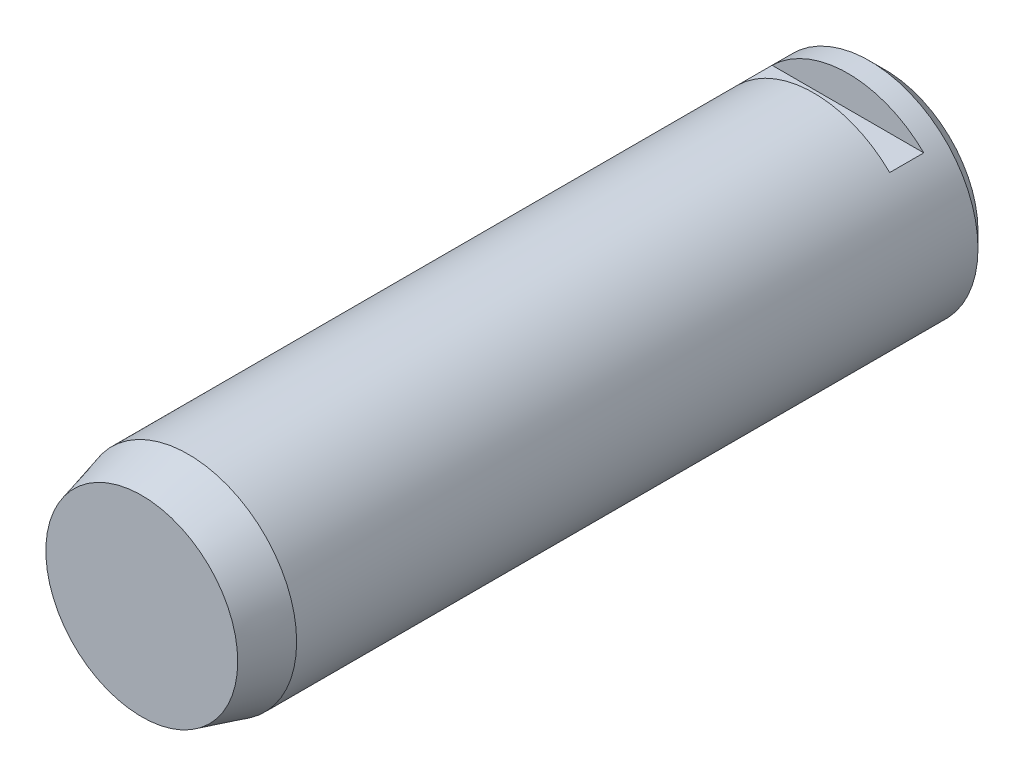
ISO-10303-21;
HEADER;
FILE_DESCRIPTION(('STEP AP214'),'2;1');
FILE_NAME('part.step','',(''),(''),'','','');
FILE_SCHEMA(('AUTOMOTIVE_DESIGN { 1 0 10303 214 1 1 1 1 }'));
ENDSEC;
DATA;
#1=APPLICATION_CONTEXT('core data for automotive mechanical design processes');
#2=APPLICATION_PROTOCOL_DEFINITION('international standard','automotive_design',2000,#1);
#3=PRODUCT_CONTEXT('',#1,'mechanical');
#4=PRODUCT('Part','Part','',(#3));
#5=PRODUCT_RELATED_PRODUCT_CATEGORY('part','',(#4));
#6=PRODUCT_DEFINITION_FORMATION('','',#4);
#7=PRODUCT_DEFINITION_CONTEXT('part definition',#1,'design');
#8=PRODUCT_DEFINITION('design','',#6,#7);
#9=PRODUCT_DEFINITION_SHAPE('','',#8);
#10=(LENGTH_UNIT() NAMED_UNIT(*) SI_UNIT(.MILLI.,.METRE.));
#11=(NAMED_UNIT(*) PLANE_ANGLE_UNIT() SI_UNIT($,.RADIAN.));
#12=(NAMED_UNIT(*) SI_UNIT($,.STERADIAN.) SOLID_ANGLE_UNIT());
#13=UNCERTAINTY_MEASURE_WITH_UNIT(LENGTH_MEASURE(1.E-05),#10,'distance_accuracy_value','');
#14=(GEOMETRIC_REPRESENTATION_CONTEXT(3) GLOBAL_UNCERTAINTY_ASSIGNED_CONTEXT((#13)) GLOBAL_UNIT_ASSIGNED_CONTEXT((#10,
#11,#12)) REPRESENTATION_CONTEXT('',''));
#15=CARTESIAN_POINT('',(0.,0.,0.));
#16=DIRECTION('',(0.,0.,1.));
#17=DIRECTION('',(1.,0.,0.));
#18=AXIS2_PLACEMENT_3D('',#15,#16,#17);
#19=CARTESIAN_POINT('',(0.,0.,240.));
#20=DIRECTION('',(0.,0.,-1.));
#21=DIRECTION('',(-1.,0.,0.));
#22=AXIS2_PLACEMENT_3D('',#19,#20,#21);
#23=CYLINDRICAL_SURFACE('',#22,35.);
#24=CARTESIAN_POINT('',(-8.88178419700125E-13,0.,5.00000000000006));
#25=DIRECTION('',(0.,0.,1.));
#26=DIRECTION('',(1.,0.,0.));
#27=AXIS2_PLACEMENT_3D('',#24,#25,#26);
#28=CIRCLE('',#27,35.);
#29=CARTESIAN_POINT('',(34.9999999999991,0.,5.00000000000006));
#30=VERTEX_POINT('',#29);
#31=EDGE_CURVE('E41',#30,#30,#28,.T.);
#32=ORIENTED_EDGE('',*,*,#31,.T.);
#33=EDGE_LOOP('',(#32));
#34=FACE_BOUND('',#33,.T.);
#35=CARTESIAN_POINT('',(0.,0.,22.9999999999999));
#36=DIRECTION('',(0.,0.,-1.));
#37=DIRECTION('',(-1.,0.,0.));
#38=AXIS2_PLACEMENT_3D('',#35,#36,#37);
#39=CIRCLE('',#38,35.);
#40=CARTESIAN_POINT('',(24.4948974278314,25.0000000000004,22.9999999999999));
#41=VERTEX_POINT('',#40);
#42=CARTESIAN_POINT('',(-24.4948974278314,25.0000000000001,22.9999999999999));
#43=VERTEX_POINT('',#42);
#44=EDGE_CURVE('E47',#41,#43,#39,.F.);
#45=ORIENTED_EDGE('',*,*,#44,.T.);
#46=DIRECTION('',(0.,0.,-1.));
#47=VECTOR('',#46,1.);
#48=CARTESIAN_POINT('',(-24.4948974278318,24.9999999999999,240.));
#49=LINE('',#48,#47);
#50=CARTESIAN_POINT('',(-24.4948974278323,24.9999999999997,11.9999999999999));
#51=VERTEX_POINT('',#50);
#52=EDGE_CURVE('E71',#51,#43,#49,.F.);
#53=ORIENTED_EDGE('',*,*,#52,.F.);
#54=CARTESIAN_POINT('',(0.,-2.22044604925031E-13,11.9999999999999));
#55=DIRECTION('',(0.,0.,1.));
#56=DIRECTION('',(1.,0.,0.));
#57=AXIS2_PLACEMENT_3D('',#54,#55,#56);
#58=CIRCLE('',#57,35.);
#59=CARTESIAN_POINT('',(24.4948974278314,24.9999999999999,11.9999999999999));
#60=VERTEX_POINT('',#59);
#61=EDGE_CURVE('E63',#51,#60,#58,.F.);
#62=ORIENTED_EDGE('',*,*,#61,.T.);
#63=DIRECTION('',(0.,0.,-1.));
#64=VECTOR('',#63,1.);
#65=CARTESIAN_POINT('',(24.4948974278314,24.9999999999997,240.));
#66=LINE('',#65,#64);
#67=EDGE_CURVE('E68',#41,#60,#66,.T.);
#68=ORIENTED_EDGE('',*,*,#67,.F.);
#69=EDGE_LOOP('',(#45,#53,#62,#68));
#70=FACE_BOUND('',#69,.T.);
#71=CARTESIAN_POINT('',(0.,0.,225.));
#72=DIRECTION('',(0.,0.,1.));
#73=DIRECTION('',(1.,0.,0.));
#74=AXIS2_PLACEMENT_3D('',#71,#72,#73);
#75=CIRCLE('',#74,35.);
#76=CARTESIAN_POINT('',(35.,0.,225.));
#77=VERTEX_POINT('',#76);
#78=EDGE_CURVE('E82',#77,#77,#75,.F.);
#79=ORIENTED_EDGE('',*,*,#78,.T.);
#80=EDGE_LOOP('',(#79));
#81=FACE_BOUND('',#80,.T.);
#82=ADVANCED_FACE('F34',(#34,#70,#81),#23,.T.);
#83=CARTESIAN_POINT('',(0.,0.,240.));
#84=DIRECTION('',(0.,0.,1.));
#85=DIRECTION('',(1.,0.,0.));
#86=AXIS2_PLACEMENT_3D('',#83,#84,#85);
#87=PLANE('',#86);
#88=CARTESIAN_POINT('',(0.,0.,240.));
#89=DIRECTION('',(0.,0.,1.));
#90=DIRECTION('',(1.,0.,0.));
#91=AXIS2_PLACEMENT_3D('',#88,#89,#90);
#92=CIRCLE('',#91,30.9807621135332);
#93=CARTESIAN_POINT('',(30.9807621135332,0.,240.));
#94=VERTEX_POINT('',#93);
#95=EDGE_CURVE('E79',#94,#94,#92,.T.);
#96=ORIENTED_EDGE('',*,*,#95,.T.);
#97=EDGE_LOOP('',(#96));
#98=FACE_BOUND('',#97,.T.);
#99=ADVANCED_FACE('F99',(#98),#87,.T.);
#100=CARTESIAN_POINT('',(0.,0.,0.));
#101=DIRECTION('',(0.,0.,1.));
#102=DIRECTION('',(1.,0.,0.));
#103=AXIS2_PLACEMENT_3D('',#100,#101,#102);
#104=PLANE('',#103);
#105=CARTESIAN_POINT('',(0.,0.,0.));
#106=DIRECTION('',(0.,0.,1.));
#107=DIRECTION('',(1.,0.,0.));
#108=AXIS2_PLACEMENT_3D('',#105,#106,#107);
#109=CIRCLE('',#108,30.);
#110=CARTESIAN_POINT('',(30.,0.,0.));
#111=VERTEX_POINT('',#110);
#112=EDGE_CURVE('E11',#111,#111,#109,.F.);
#113=ORIENTED_EDGE('',*,*,#112,.T.);
#114=EDGE_LOOP('',(#113));
#115=FACE_BOUND('',#114,.T.);
#116=ADVANCED_FACE('F103',(#115),#104,.F.);
#117=CARTESIAN_POINT('',(0.,0.,240.));
#118=DIRECTION('',(0.,0.,-1.));
#119=DIRECTION('',(-1.,0.,0.));
#120=AXIS2_PLACEMENT_3D('',#117,#118,#119);
#121=CONICAL_SURFACE('',#120,30.9807621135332,0.261799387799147);
#122=ORIENTED_EDGE('',*,*,#78,.F.);
#123=EDGE_LOOP('',(#122));
#124=FACE_BOUND('',#123,.T.);
#125=ORIENTED_EDGE('',*,*,#95,.F.);
#126=EDGE_LOOP('',(#125));
#127=FACE_BOUND('',#126,.T.);
#128=ADVANCED_FACE('F108',(#124,#127),#121,.T.);
#129=CARTESIAN_POINT('',(35.0000000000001,35.0010000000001,11.9999999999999));
#130=DIRECTION('',(0.,0.,1.));
#131=DIRECTION('',(1.,0.,0.));
#132=AXIS2_PLACEMENT_3D('',#129,#130,#131);
#133=PLANE('',#132);
#134=DIRECTION('',(-1.,0.,0.));
#135=VECTOR('',#134,1.);
#136=CARTESIAN_POINT('',(35.0000000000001,24.9999999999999,11.9999999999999));
#137=LINE('',#136,#135);
#138=EDGE_CURVE('E55',#60,#51,#137,.T.);
#139=ORIENTED_EDGE('',*,*,#138,.F.);
#140=ORIENTED_EDGE('',*,*,#61,.F.);
#141=EDGE_LOOP('',(#139,#140));
#142=FACE_BOUND('',#141,.T.);
#143=ADVANCED_FACE('F61',(#142),#133,.T.);
#144=CARTESIAN_POINT('',(35.0000000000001,35.0010000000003,22.9999999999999));
#145=DIRECTION('',(0.,0.,-1.));
#146=DIRECTION('',(-1.,0.,0.));
#147=AXIS2_PLACEMENT_3D('',#144,#145,#146);
#148=PLANE('',#147);
#149=DIRECTION('',(1.,0.,0.));
#150=VECTOR('',#149,1.);
#151=CARTESIAN_POINT('',(35.0000000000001,25.0000000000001,22.9999999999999));
#152=LINE('',#151,#150);
#153=EDGE_CURVE('E65',#43,#41,#152,.T.);
#154=ORIENTED_EDGE('',*,*,#153,.F.);
#155=ORIENTED_EDGE('',*,*,#44,.F.);
#156=EDGE_LOOP('',(#154,#155));
#157=FACE_BOUND('',#156,.T.);
#158=ADVANCED_FACE('F95',(#157),#148,.T.);
#159=CARTESIAN_POINT('',(35.0000000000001,25.0000000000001,22.9999999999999));
#160=DIRECTION('',(0.,-1.,0.));
#161=DIRECTION('',(0.,0.,-1.));
#162=AXIS2_PLACEMENT_3D('',#159,#160,#161);
#163=PLANE('',#162);
#164=ORIENTED_EDGE('',*,*,#52,.T.);
#165=ORIENTED_EDGE('',*,*,#153,.T.);
#166=ORIENTED_EDGE('',*,*,#67,.T.);
#167=ORIENTED_EDGE('',*,*,#138,.T.);
#168=EDGE_LOOP('',(#164,#165,#166,#167));
#169=FACE_BOUND('',#168,.T.);
#170=ADVANCED_FACE('F69',(#169),#163,.F.);
#171=CARTESIAN_POINT('',(-8.88178419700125E-13,0.,5.00000000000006));
#172=DIRECTION('',(0.,0.,1.));
#173=DIRECTION('',(1.,0.,0.));
#174=AXIS2_PLACEMENT_3D('',#171,#172,#173);
#175=CONICAL_SURFACE('',#174,35.,0.785398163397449);
#176=ORIENTED_EDGE('',*,*,#112,.F.);
#177=EDGE_LOOP('',(#176));
#178=FACE_BOUND('',#177,.T.);
#179=ORIENTED_EDGE('',*,*,#31,.F.);
#180=EDGE_LOOP('',(#179));
#181=FACE_BOUND('',#180,.T.);
#182=ADVANCED_FACE('F88',(#178,#181),#175,.T.);
#183=CLOSED_SHELL('',(#82,#99,#116,#128,#143,#158,#170,#182));
#184=MANIFOLD_SOLID_BREP('B2',#183);
#185=ADVANCED_BREP_SHAPE_REPRESENTATION('',(#18,#184),#14);
#186=SHAPE_DEFINITION_REPRESENTATION(#9,#185);
ENDSEC;
END-ISO-10303-21;
